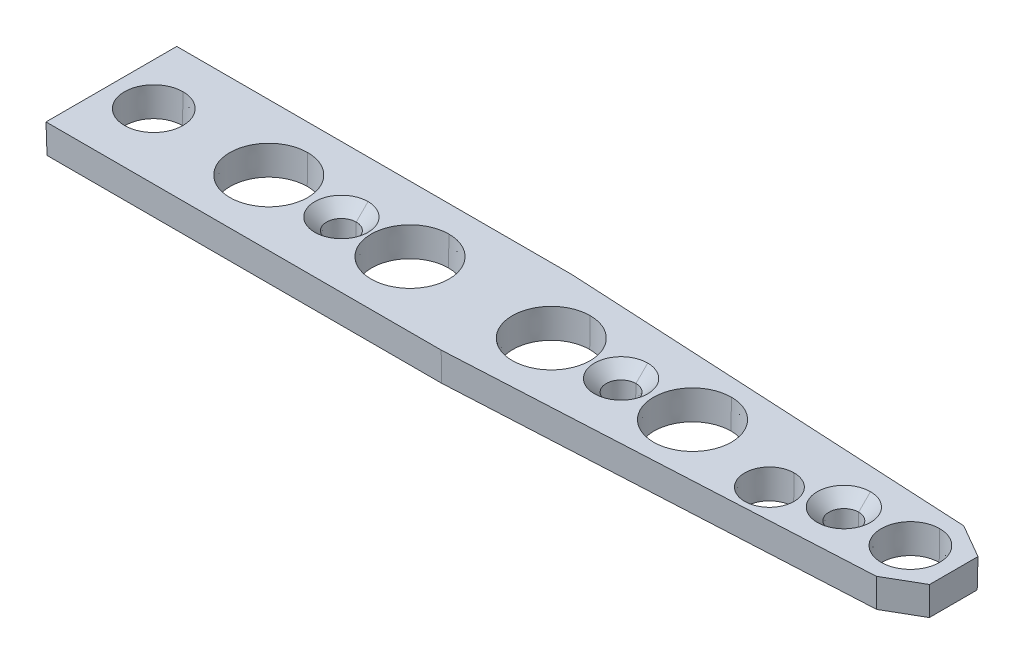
ISO-10303-21;
HEADER;
FILE_DESCRIPTION(('STEP AP214'),'2;1');
FILE_NAME('part.step','',(''),(''),'','','');
FILE_SCHEMA(('AUTOMOTIVE_DESIGN { 1 0 10303 214 1 1 1 1 }'));
ENDSEC;
DATA;
#1=APPLICATION_CONTEXT('core data for automotive mechanical design processes');
#2=APPLICATION_PROTOCOL_DEFINITION('international standard','automotive_design',2000,#1);
#3=PRODUCT_CONTEXT('',#1,'mechanical');
#4=PRODUCT('Part','Part','',(#3));
#5=PRODUCT_RELATED_PRODUCT_CATEGORY('part','',(#4));
#6=PRODUCT_DEFINITION_FORMATION('','',#4);
#7=PRODUCT_DEFINITION_CONTEXT('part definition',#1,'design');
#8=PRODUCT_DEFINITION('design','',#6,#7);
#9=PRODUCT_DEFINITION_SHAPE('','',#8);
#10=(LENGTH_UNIT() NAMED_UNIT(*) SI_UNIT(.MILLI.,.METRE.));
#11=(NAMED_UNIT(*) PLANE_ANGLE_UNIT() SI_UNIT($,.RADIAN.));
#12=(NAMED_UNIT(*) SI_UNIT($,.STERADIAN.) SOLID_ANGLE_UNIT());
#13=UNCERTAINTY_MEASURE_WITH_UNIT(LENGTH_MEASURE(1.E-05),#10,'distance_accuracy_value','');
#14=(GEOMETRIC_REPRESENTATION_CONTEXT(3) GLOBAL_UNCERTAINTY_ASSIGNED_CONTEXT((#13)) GLOBAL_UNIT_ASSIGNED_CONTEXT((#10,
#11,#12)) REPRESENTATION_CONTEXT('',''));
#15=CARTESIAN_POINT('',(0.,0.,0.));
#16=DIRECTION('',(0.,0.,1.));
#17=DIRECTION('',(1.,0.,0.));
#18=AXIS2_PLACEMENT_3D('',#15,#16,#17);
#19=CARTESIAN_POINT('',(56.,-2.4,1.65));
#20=DIRECTION('',(0.,1.,0.));
#21=DIRECTION('',(0.,0.,1.));
#22=AXIS2_PLACEMENT_3D('',#19,#20,#21);
#23=CONICAL_SURFACE('',#22,2.,0.0174532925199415);
#24=DIRECTION('',(0.,0.999847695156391,-0.0174524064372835));
#25=VECTOR('',#24,1.);
#26=CARTESIAN_POINT('',(56.,-2.4,-0.35));
#27=LINE('',#26,#25);
#28=CARTESIAN_POINT('',(56.,-2.4,-0.35));
#29=VERTEX_POINT('',#28);
#30=CARTESIAN_POINT('',(56.,0.,-0.391892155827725));
#31=VERTEX_POINT('',#30);
#32=EDGE_CURVE('E575',#29,#31,#27,.T.);
#33=ORIENTED_EDGE('',*,*,#32,.F.);
#34=CARTESIAN_POINT('',(56.,-2.4,1.65));
#35=DIRECTION('',(0.,1.,0.));
#36=DIRECTION('',(0.,0.,1.));
#37=AXIS2_PLACEMENT_3D('',#34,#35,#36);
#38=CIRCLE('',#37,2.);
#39=CARTESIAN_POINT('',(56.,-2.4,3.65));
#40=VERTEX_POINT('',#39);
#41=EDGE_CURVE('E424',#40,#29,#38,.T.);
#42=ORIENTED_EDGE('',*,*,#41,.F.);
#43=DIRECTION('',(0.,0.999847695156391,0.0174524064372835));
#44=VECTOR('',#43,1.);
#45=CARTESIAN_POINT('',(56.,-2.4,3.65));
#46=LINE('',#45,#44);
#47=CARTESIAN_POINT('',(56.,0.,3.69189215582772));
#48=VERTEX_POINT('',#47);
#49=EDGE_CURVE('E518',#40,#48,#46,.T.);
#50=ORIENTED_EDGE('',*,*,#49,.T.);
#51=CARTESIAN_POINT('',(56.,0.,1.65));
#52=DIRECTION('',(0.,1.,0.));
#53=DIRECTION('',(0.,0.,1.));
#54=AXIS2_PLACEMENT_3D('',#51,#52,#53);
#55=CIRCLE('',#54,2.04189215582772);
#56=EDGE_CURVE('E329',#48,#31,#55,.T.);
#57=ORIENTED_EDGE('',*,*,#56,.T.);
#58=EDGE_LOOP('',(#33,#42,#50,#57));
#59=FACE_BOUND('',#58,.T.);
#60=ADVANCED_FACE('F16',(#59),#23,.F.);
#61=CARTESIAN_POINT('',(13.,-2.4,0.));
#62=DIRECTION('',(0.,1.,0.));
#63=DIRECTION('',(0.,0.,1.));
#64=AXIS2_PLACEMENT_3D('',#61,#62,#63);
#65=CONICAL_SURFACE('',#64,3.175,0.0174532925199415);
#66=DIRECTION('',(0.,0.999847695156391,-0.0174524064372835));
#67=VECTOR('',#66,1.);
#68=CARTESIAN_POINT('',(13.,-2.4,-3.175));
#69=LINE('',#68,#67);
#70=CARTESIAN_POINT('',(13.,-2.4,-3.175));
#71=VERTEX_POINT('',#70);
#72=CARTESIAN_POINT('',(13.,0.,-3.21689215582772));
#73=VERTEX_POINT('',#72);
#74=EDGE_CURVE('E517',#71,#73,#69,.T.);
#75=ORIENTED_EDGE('',*,*,#74,.F.);
#76=CARTESIAN_POINT('',(13.,-2.4,0.));
#77=DIRECTION('',(0.,1.,0.));
#78=DIRECTION('',(0.,0.,1.));
#79=AXIS2_PLACEMENT_3D('',#76,#77,#78);
#80=CIRCLE('',#79,3.175);
#81=CARTESIAN_POINT('',(13.,-2.4,3.175));
#82=VERTEX_POINT('',#81);
#83=EDGE_CURVE('E427',#82,#71,#80,.T.);
#84=ORIENTED_EDGE('',*,*,#83,.F.);
#85=DIRECTION('',(0.,0.999847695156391,0.0174524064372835));
#86=VECTOR('',#85,1.);
#87=CARTESIAN_POINT('',(13.,-2.4,3.175));
#88=LINE('',#87,#86);
#89=CARTESIAN_POINT('',(13.,0.,3.21689215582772));
#90=VERTEX_POINT('',#89);
#91=EDGE_CURVE('E374',#82,#90,#88,.T.);
#92=ORIENTED_EDGE('',*,*,#91,.T.);
#93=CARTESIAN_POINT('',(13.,0.,0.));
#94=DIRECTION('',(0.,1.,0.));
#95=DIRECTION('',(0.,0.,1.));
#96=AXIS2_PLACEMENT_3D('',#93,#94,#95);
#97=CIRCLE('',#96,3.21689215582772);
#98=EDGE_CURVE('E397',#90,#73,#97,.T.);
#99=ORIENTED_EDGE('',*,*,#98,.T.);
#100=EDGE_LOOP('',(#75,#84,#92,#99));
#101=FACE_BOUND('',#100,.T.);
#102=ADVANCED_FACE('F650',(#101),#65,.F.);
#103=CARTESIAN_POINT('',(24.6666666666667,-2.4,0.));
#104=DIRECTION('',(0.,1.,0.));
#105=DIRECTION('',(0.,0.,1.));
#106=AXIS2_PLACEMENT_3D('',#103,#104,#105);
#107=CONICAL_SURFACE('',#106,3.175,0.0174532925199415);
#108=DIRECTION('',(0.,0.999847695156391,-0.0174524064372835));
#109=VECTOR('',#108,1.);
#110=CARTESIAN_POINT('',(24.6666666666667,-2.4,-3.175));
#111=LINE('',#110,#109);
#112=CARTESIAN_POINT('',(24.6666666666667,-2.4,-3.175));
#113=VERTEX_POINT('',#112);
#114=CARTESIAN_POINT('',(24.6666666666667,0.,-3.21689215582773));
#115=VERTEX_POINT('',#114);
#116=EDGE_CURVE('E373',#113,#115,#111,.T.);
#117=ORIENTED_EDGE('',*,*,#116,.F.);
#118=CARTESIAN_POINT('',(24.6666666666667,-2.4,0.));
#119=DIRECTION('',(0.,1.,0.));
#120=DIRECTION('',(0.,0.,1.));
#121=AXIS2_PLACEMENT_3D('',#118,#119,#120);
#122=CIRCLE('',#121,3.175);
#123=CARTESIAN_POINT('',(24.6666666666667,-2.4,3.175));
#124=VERTEX_POINT('',#123);
#125=EDGE_CURVE('E145',#124,#113,#122,.T.);
#126=ORIENTED_EDGE('',*,*,#125,.F.);
#127=DIRECTION('',(0.,0.999847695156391,0.0174524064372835));
#128=VECTOR('',#127,1.);
#129=CARTESIAN_POINT('',(24.6666666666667,-2.4,3.175));
#130=LINE('',#129,#128);
#131=CARTESIAN_POINT('',(24.6666666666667,0.,3.21689215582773));
#132=VERTEX_POINT('',#131);
#133=EDGE_CURVE('E394',#124,#132,#130,.T.);
#134=ORIENTED_EDGE('',*,*,#133,.T.);
#135=CARTESIAN_POINT('',(24.6666666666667,0.,0.));
#136=DIRECTION('',(0.,1.,0.));
#137=DIRECTION('',(0.,0.,1.));
#138=AXIS2_PLACEMENT_3D('',#135,#136,#137);
#139=CIRCLE('',#138,3.21689215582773);
#140=EDGE_CURVE('E134',#132,#115,#139,.T.);
#141=ORIENTED_EDGE('',*,*,#140,.T.);
#142=EDGE_LOOP('',(#117,#126,#134,#141));
#143=FACE_BOUND('',#142,.T.);
#144=ADVANCED_FACE('F708',(#143),#107,.F.);
#145=CARTESIAN_POINT('',(36.3333333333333,-2.4,0.));
#146=DIRECTION('',(0.,1.,0.));
#147=DIRECTION('',(0.,0.,1.));
#148=AXIS2_PLACEMENT_3D('',#145,#146,#147);
#149=CONICAL_SURFACE('',#148,3.175,0.0174532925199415);
#150=DIRECTION('',(0.,0.999847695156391,-0.0174524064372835));
#151=VECTOR('',#150,1.);
#152=CARTESIAN_POINT('',(36.3333333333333,-2.4,-3.175));
#153=LINE('',#152,#151);
#154=CARTESIAN_POINT('',(36.3333333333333,-2.4,-3.175));
#155=VERTEX_POINT('',#154);
#156=CARTESIAN_POINT('',(36.3333333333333,0.,-3.21689215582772));
#157=VERTEX_POINT('',#156);
#158=EDGE_CURVE('E433',#155,#157,#153,.T.);
#159=ORIENTED_EDGE('',*,*,#158,.F.);
#160=CARTESIAN_POINT('',(36.3333333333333,-2.4,0.));
#161=DIRECTION('',(0.,1.,0.));
#162=DIRECTION('',(0.,0.,1.));
#163=AXIS2_PLACEMENT_3D('',#160,#161,#162);
#164=CIRCLE('',#163,3.175);
#165=CARTESIAN_POINT('',(36.3333333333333,-2.4,3.175));
#166=VERTEX_POINT('',#165);
#167=EDGE_CURVE('E458',#166,#155,#164,.T.);
#168=ORIENTED_EDGE('',*,*,#167,.F.);
#169=DIRECTION('',(0.,0.999847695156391,0.0174524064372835));
#170=VECTOR('',#169,1.);
#171=CARTESIAN_POINT('',(36.3333333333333,-2.4,3.175));
#172=LINE('',#171,#170);
#173=CARTESIAN_POINT('',(36.3333333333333,0.,3.21689215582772));
#174=VERTEX_POINT('',#173);
#175=EDGE_CURVE('E432',#166,#174,#172,.T.);
#176=ORIENTED_EDGE('',*,*,#175,.T.);
#177=CARTESIAN_POINT('',(36.3333333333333,0.,0.));
#178=DIRECTION('',(0.,1.,0.));
#179=DIRECTION('',(0.,0.,1.));
#180=AXIS2_PLACEMENT_3D('',#177,#178,#179);
#181=CIRCLE('',#180,3.21689215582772);
#182=EDGE_CURVE('E440',#174,#157,#181,.T.);
#183=ORIENTED_EDGE('',*,*,#182,.T.);
#184=EDGE_LOOP('',(#159,#168,#176,#183));
#185=FACE_BOUND('',#184,.T.);
#186=ADVANCED_FACE('F760',(#185),#149,.F.);
#187=CARTESIAN_POINT('',(48.,-2.4,0.));
#188=DIRECTION('',(0.,1.,0.));
#189=DIRECTION('',(0.,0.,1.));
#190=AXIS2_PLACEMENT_3D('',#187,#188,#189);
#191=CONICAL_SURFACE('',#190,3.175,0.0174532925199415);
#192=DIRECTION('',(0.,0.999847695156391,-0.0174524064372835));
#193=VECTOR('',#192,1.);
#194=CARTESIAN_POINT('',(48.,-2.4,-3.175));
#195=LINE('',#194,#193);
#196=CARTESIAN_POINT('',(48.,-2.4,-3.175));
#197=VERTEX_POINT('',#196);
#198=CARTESIAN_POINT('',(48.,0.,-3.21689215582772));
#199=VERTEX_POINT('',#198);
#200=EDGE_CURVE('E407',#197,#199,#195,.T.);
#201=ORIENTED_EDGE('',*,*,#200,.F.);
#202=CARTESIAN_POINT('',(48.,-2.4,0.));
#203=DIRECTION('',(0.,1.,0.));
#204=DIRECTION('',(0.,0.,1.));
#205=AXIS2_PLACEMENT_3D('',#202,#203,#204);
#206=CIRCLE('',#205,3.175);
#207=CARTESIAN_POINT('',(48.,-2.4,3.175));
#208=VERTEX_POINT('',#207);
#209=EDGE_CURVE('E437',#208,#197,#206,.T.);
#210=ORIENTED_EDGE('',*,*,#209,.F.);
#211=DIRECTION('',(0.,0.999847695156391,0.0174524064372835));
#212=VECTOR('',#211,1.);
#213=CARTESIAN_POINT('',(48.,-2.4,3.175));
#214=LINE('',#213,#212);
#215=CARTESIAN_POINT('',(48.,0.,3.21689215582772));
#216=VERTEX_POINT('',#215);
#217=EDGE_CURVE('E493',#208,#216,#214,.T.);
#218=ORIENTED_EDGE('',*,*,#217,.T.);
#219=CARTESIAN_POINT('',(48.,0.,0.));
#220=DIRECTION('',(0.,1.,0.));
#221=DIRECTION('',(0.,0.,1.));
#222=AXIS2_PLACEMENT_3D('',#219,#220,#221);
#223=CIRCLE('',#222,3.21689215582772);
#224=EDGE_CURVE('E448',#216,#199,#223,.T.);
#225=ORIENTED_EDGE('',*,*,#224,.T.);
#226=EDGE_LOOP('',(#201,#210,#218,#225));
#227=FACE_BOUND('',#226,.T.);
#228=ADVANCED_FACE('F757',(#227),#191,.F.);
#229=CARTESIAN_POINT('',(19.,0.,0.));
#230=DIRECTION('',(0.,1.,0.));
#231=DIRECTION('',(0.,0.,1.));
#232=AXIS2_PLACEMENT_3D('',#229,#230,#231);
#233=CONICAL_SURFACE('',#232,2.2,0.785398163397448);
#234=DIRECTION('',(0.,0.707106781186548,-0.707106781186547));
#235=VECTOR('',#234,1.);
#236=CARTESIAN_POINT('',(19.,0.,-2.2));
#237=LINE('',#236,#235);
#238=CARTESIAN_POINT('',(19.,-0.975128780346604,-1.2248712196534));
#239=VERTEX_POINT('',#238);
#240=CARTESIAN_POINT('',(19.,0.,-2.2));
#241=VERTEX_POINT('',#240);
#242=EDGE_CURVE('E492',#239,#241,#237,.T.);
#243=ORIENTED_EDGE('',*,*,#242,.F.);
#244=CARTESIAN_POINT('',(19.,-0.975128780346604,0.));
#245=DIRECTION('',(0.,1.,0.));
#246=DIRECTION('',(0.,0.,1.));
#247=AXIS2_PLACEMENT_3D('',#244,#245,#246);
#248=CIRCLE('',#247,1.2248712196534);
#249=CARTESIAN_POINT('',(19.,-0.975128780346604,1.2248712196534));
#250=VERTEX_POINT('',#249);
#251=EDGE_CURVE('E10',#250,#239,#248,.T.);
#252=ORIENTED_EDGE('',*,*,#251,.F.);
#253=DIRECTION('',(0.,0.707106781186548,0.707106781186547));
#254=VECTOR('',#253,1.);
#255=CARTESIAN_POINT('',(19.,0.,2.2));
#256=LINE('',#255,#254);
#257=CARTESIAN_POINT('',(19.,0.,2.2));
#258=VERTEX_POINT('',#257);
#259=EDGE_CURVE('E491',#250,#258,#256,.T.);
#260=ORIENTED_EDGE('',*,*,#259,.T.);
#261=CARTESIAN_POINT('',(19.,0.,0.));
#262=DIRECTION('',(0.,1.,0.));
#263=DIRECTION('',(0.,0.,1.));
#264=AXIS2_PLACEMENT_3D('',#261,#262,#263);
#265=CIRCLE('',#264,2.2);
#266=EDGE_CURVE('E559',#258,#241,#265,.T.);
#267=ORIENTED_EDGE('',*,*,#266,.T.);
#268=EDGE_LOOP('',(#243,#252,#260,#267));
#269=FACE_BOUND('',#268,.T.);
#270=ADVANCED_FACE('F759',(#269),#233,.F.);
#271=CARTESIAN_POINT('',(19.,-2.4,0.));
#272=DIRECTION('',(0.,1.,0.));
#273=DIRECTION('',(0.,0.,1.));
#274=AXIS2_PLACEMENT_3D('',#271,#272,#273);
#275=CONICAL_SURFACE('',#274,1.2,0.0174532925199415);
#276=DIRECTION('',(0.,0.999847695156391,-0.0174524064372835));
#277=VECTOR('',#276,1.);
#278=CARTESIAN_POINT('',(19.,-2.4,-1.2));
#279=LINE('',#278,#277);
#280=CARTESIAN_POINT('',(19.,-2.4,-1.2));
#281=VERTEX_POINT('',#280);
#282=EDGE_CURVE('E535',#281,#239,#279,.T.);
#283=ORIENTED_EDGE('',*,*,#282,.F.);
#284=CARTESIAN_POINT('',(19.,-2.4,0.));
#285=DIRECTION('',(0.,1.,0.));
#286=DIRECTION('',(0.,0.,1.));
#287=AXIS2_PLACEMENT_3D('',#284,#285,#286);
#288=CIRCLE('',#287,1.2);
#289=CARTESIAN_POINT('',(19.,-2.4,1.2));
#290=VERTEX_POINT('',#289);
#291=EDGE_CURVE('E247',#290,#281,#288,.T.);
#292=ORIENTED_EDGE('',*,*,#291,.F.);
#293=DIRECTION('',(0.,0.999847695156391,0.0174524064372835));
#294=VECTOR('',#293,1.);
#295=CARTESIAN_POINT('',(19.,-2.4,1.2));
#296=LINE('',#295,#294);
#297=EDGE_CURVE('E532',#290,#250,#296,.T.);
#298=ORIENTED_EDGE('',*,*,#297,.T.);
#299=ORIENTED_EDGE('',*,*,#251,.T.);
#300=EDGE_LOOP('',(#283,#292,#298,#299));
#301=FACE_BOUND('',#300,.T.);
#302=ADVANCED_FACE('F767',(#301),#275,.F.);
#303=CARTESIAN_POINT('',(42.1,0.,0.));
#304=DIRECTION('',(0.,1.,0.));
#305=DIRECTION('',(0.,0.,1.));
#306=AXIS2_PLACEMENT_3D('',#303,#304,#305);
#307=CONICAL_SURFACE('',#306,2.2,0.785398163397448);
#308=DIRECTION('',(0.,0.707106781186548,-0.707106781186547));
#309=VECTOR('',#308,1.);
#310=CARTESIAN_POINT('',(42.1,0.,-2.2));
#311=LINE('',#310,#309);
#312=CARTESIAN_POINT('',(42.1,-0.975128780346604,-1.2248712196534));
#313=VERTEX_POINT('',#312);
#314=CARTESIAN_POINT('',(42.1,0.,-2.2));
#315=VERTEX_POINT('',#314);
#316=EDGE_CURVE('E358',#313,#315,#311,.T.);
#317=ORIENTED_EDGE('',*,*,#316,.F.);
#318=CARTESIAN_POINT('',(42.1,-0.975128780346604,0.));
#319=DIRECTION('',(0.,1.,0.));
#320=DIRECTION('',(0.,0.,1.));
#321=AXIS2_PLACEMENT_3D('',#318,#319,#320);
#322=CIRCLE('',#321,1.2248712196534);
#323=CARTESIAN_POINT('',(42.1,-0.975128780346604,1.2248712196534));
#324=VERTEX_POINT('',#323);
#325=EDGE_CURVE('E27',#324,#313,#322,.T.);
#326=ORIENTED_EDGE('',*,*,#325,.F.);
#327=DIRECTION('',(0.,0.707106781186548,0.707106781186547));
#328=VECTOR('',#327,1.);
#329=CARTESIAN_POINT('',(42.1,0.,2.2));
#330=LINE('',#329,#328);
#331=CARTESIAN_POINT('',(42.1,0.,2.2));
#332=VERTEX_POINT('',#331);
#333=EDGE_CURVE('E581',#324,#332,#330,.T.);
#334=ORIENTED_EDGE('',*,*,#333,.T.);
#335=CARTESIAN_POINT('',(42.1,0.,0.));
#336=DIRECTION('',(0.,1.,0.));
#337=DIRECTION('',(0.,0.,1.));
#338=AXIS2_PLACEMENT_3D('',#335,#336,#337);
#339=CIRCLE('',#338,2.2);
#340=EDGE_CURVE('E599',#332,#315,#339,.T.);
#341=ORIENTED_EDGE('',*,*,#340,.T.);
#342=EDGE_LOOP('',(#317,#326,#334,#341));
#343=FACE_BOUND('',#342,.T.);
#344=ADVANCED_FACE('F726',(#343),#307,.F.);
#345=CARTESIAN_POINT('',(42.1,-2.4,0.));
#346=DIRECTION('',(0.,1.,0.));
#347=DIRECTION('',(0.,0.,1.));
#348=AXIS2_PLACEMENT_3D('',#345,#346,#347);
#349=CONICAL_SURFACE('',#348,1.2,0.0174532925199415);
#350=DIRECTION('',(0.,0.999847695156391,-0.0174524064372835));
#351=VECTOR('',#350,1.);
#352=CARTESIAN_POINT('',(42.1,-2.4,-1.2));
#353=LINE('',#352,#351);
#354=CARTESIAN_POINT('',(42.1,-2.4,-1.2));
#355=VERTEX_POINT('',#354);
#356=EDGE_CURVE('E364',#355,#313,#353,.T.);
#357=ORIENTED_EDGE('',*,*,#356,.F.);
#358=CARTESIAN_POINT('',(42.1,-2.4,0.));
#359=DIRECTION('',(0.,1.,0.));
#360=DIRECTION('',(0.,0.,1.));
#361=AXIS2_PLACEMENT_3D('',#358,#359,#360);
#362=CIRCLE('',#361,1.2);
#363=CARTESIAN_POINT('',(42.1,-2.4,1.2));
#364=VERTEX_POINT('',#363);
#365=EDGE_CURVE('E436',#364,#355,#362,.T.);
#366=ORIENTED_EDGE('',*,*,#365,.F.);
#367=DIRECTION('',(0.,0.999847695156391,0.0174524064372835));
#368=VECTOR('',#367,1.);
#369=CARTESIAN_POINT('',(42.1,-2.4,1.2));
#370=LINE('',#369,#368);
#371=EDGE_CURVE('E367',#364,#324,#370,.T.);
#372=ORIENTED_EDGE('',*,*,#371,.T.);
#373=ORIENTED_EDGE('',*,*,#325,.T.);
#374=EDGE_LOOP('',(#357,#366,#372,#373));
#375=FACE_BOUND('',#374,.T.);
#376=ADVANCED_FACE('F723',(#375),#349,.F.);
#377=CARTESIAN_POINT('',(60.5,0.,0.));
#378=DIRECTION('',(0.,1.,0.));
#379=DIRECTION('',(0.,0.,1.));
#380=AXIS2_PLACEMENT_3D('',#377,#378,#379);
#381=CONICAL_SURFACE('',#380,2.2,0.785398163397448);
#382=DIRECTION('',(0.,0.707106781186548,-0.707106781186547));
#383=VECTOR('',#382,1.);
#384=CARTESIAN_POINT('',(60.5,0.,-2.2));
#385=LINE('',#384,#383);
#386=CARTESIAN_POINT('',(60.5,-0.975128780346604,-1.2248712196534));
#387=VERTEX_POINT('',#386);
#388=CARTESIAN_POINT('',(60.5,0.,-2.2));
#389=VERTEX_POINT('',#388);
#390=EDGE_CURVE('E452',#387,#389,#385,.T.);
#391=ORIENTED_EDGE('',*,*,#390,.F.);
#392=CARTESIAN_POINT('',(60.5,-0.975128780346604,0.));
#393=DIRECTION('',(0.,1.,0.));
#394=DIRECTION('',(0.,0.,1.));
#395=AXIS2_PLACEMENT_3D('',#392,#393,#394);
#396=CIRCLE('',#395,1.2248712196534);
#397=CARTESIAN_POINT('',(60.5,-0.975128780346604,1.2248712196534));
#398=VERTEX_POINT('',#397);
#399=EDGE_CURVE('E466',#398,#387,#396,.T.);
#400=ORIENTED_EDGE('',*,*,#399,.F.);
#401=DIRECTION('',(0.,0.707106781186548,0.707106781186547));
#402=VECTOR('',#401,1.);
#403=CARTESIAN_POINT('',(60.5,0.,2.2));
#404=LINE('',#403,#402);
#405=CARTESIAN_POINT('',(60.5,0.,2.2));
#406=VERTEX_POINT('',#405);
#407=EDGE_CURVE('E596',#398,#406,#404,.T.);
#408=ORIENTED_EDGE('',*,*,#407,.T.);
#409=CARTESIAN_POINT('',(60.5,0.,0.));
#410=DIRECTION('',(0.,1.,0.));
#411=DIRECTION('',(0.,0.,1.));
#412=AXIS2_PLACEMENT_3D('',#409,#410,#411);
#413=CIRCLE('',#412,2.2);
#414=EDGE_CURVE('E20',#406,#389,#413,.T.);
#415=ORIENTED_EDGE('',*,*,#414,.T.);
#416=EDGE_LOOP('',(#391,#400,#408,#415));
#417=FACE_BOUND('',#416,.T.);
#418=ADVANCED_FACE('F716',(#417),#381,.F.);
#419=CARTESIAN_POINT('',(60.5,-2.4,0.));
#420=DIRECTION('',(0.,1.,0.));
#421=DIRECTION('',(0.,0.,1.));
#422=AXIS2_PLACEMENT_3D('',#419,#420,#421);
#423=CONICAL_SURFACE('',#422,1.2,0.0174532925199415);
#424=DIRECTION('',(0.,0.999847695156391,-0.0174524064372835));
#425=VECTOR('',#424,1.);
#426=CARTESIAN_POINT('',(60.5,-2.4,-1.2));
#427=LINE('',#426,#425);
#428=CARTESIAN_POINT('',(60.5,-2.4,-1.2));
#429=VERTEX_POINT('',#428);
#430=EDGE_CURVE('E531',#429,#387,#427,.T.);
#431=ORIENTED_EDGE('',*,*,#430,.F.);
#432=CARTESIAN_POINT('',(60.5,-2.4,0.));
#433=DIRECTION('',(0.,1.,0.));
#434=DIRECTION('',(0.,0.,1.));
#435=AXIS2_PLACEMENT_3D('',#432,#433,#434);
#436=CIRCLE('',#435,1.2);
#437=CARTESIAN_POINT('',(60.5,-2.4,1.2));
#438=VERTEX_POINT('',#437);
#439=EDGE_CURVE('E463',#438,#429,#436,.T.);
#440=ORIENTED_EDGE('',*,*,#439,.F.);
#441=DIRECTION('',(0.,0.999847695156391,0.0174524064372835));
#442=VECTOR('',#441,1.);
#443=CARTESIAN_POINT('',(60.5,-2.4,1.2));
#444=LINE('',#443,#442);
#445=EDGE_CURVE('E512',#438,#398,#444,.T.);
#446=ORIENTED_EDGE('',*,*,#445,.T.);
#447=ORIENTED_EDGE('',*,*,#399,.T.);
#448=EDGE_LOOP('',(#431,#440,#446,#447));
#449=FACE_BOUND('',#448,.T.);
#450=ADVANCED_FACE('F712',(#449),#423,.F.);
#451=CARTESIAN_POINT('',(3.5,-2.4,0.));
#452=DIRECTION('',(0.,1.,0.));
#453=DIRECTION('',(0.,0.,1.));
#454=AXIS2_PLACEMENT_3D('',#451,#452,#453);
#455=CONICAL_SURFACE('',#454,2.375,0.0174532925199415);
#456=DIRECTION('',(0.,0.999847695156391,-0.0174524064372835));
#457=VECTOR('',#456,1.);
#458=CARTESIAN_POINT('',(3.5,-2.4,-2.375));
#459=LINE('',#458,#457);
#460=CARTESIAN_POINT('',(3.5,-2.4,-2.375));
#461=VERTEX_POINT('',#460);
#462=CARTESIAN_POINT('',(3.5,0.,-2.41689215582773));
#463=VERTEX_POINT('',#462);
#464=EDGE_CURVE('E401',#461,#463,#459,.T.);
#465=ORIENTED_EDGE('',*,*,#464,.F.);
#466=CARTESIAN_POINT('',(3.5,-2.4,0.));
#467=DIRECTION('',(0.,1.,0.));
#468=DIRECTION('',(0.,0.,1.));
#469=AXIS2_PLACEMENT_3D('',#466,#467,#468);
#470=CIRCLE('',#469,2.375);
#471=CARTESIAN_POINT('',(3.5,-2.4,2.375));
#472=VERTEX_POINT('',#471);
#473=EDGE_CURVE('E467',#472,#461,#470,.T.);
#474=ORIENTED_EDGE('',*,*,#473,.F.);
#475=DIRECTION('',(0.,0.999847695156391,0.0174524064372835));
#476=VECTOR('',#475,1.);
#477=CARTESIAN_POINT('',(3.5,-2.4,2.375));
#478=LINE('',#477,#476);
#479=CARTESIAN_POINT('',(3.5,0.,2.41689215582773));
#480=VERTEX_POINT('',#479);
#481=EDGE_CURVE('E548',#472,#480,#478,.T.);
#482=ORIENTED_EDGE('',*,*,#481,.T.);
#483=CARTESIAN_POINT('',(3.5,0.,0.));
#484=DIRECTION('',(0.,1.,0.));
#485=DIRECTION('',(0.,0.,1.));
#486=AXIS2_PLACEMENT_3D('',#483,#484,#485);
#487=CIRCLE('',#486,2.41689215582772);
#488=EDGE_CURVE('E521',#480,#463,#487,.T.);
#489=ORIENTED_EDGE('',*,*,#488,.T.);
#490=EDGE_LOOP('',(#465,#474,#482,#489));
#491=FACE_BOUND('',#490,.T.);
#492=ADVANCED_FACE('F715',(#491),#455,.F.);
#493=CARTESIAN_POINT('',(66.,-2.4,0.));
#494=DIRECTION('',(0.,1.,0.));
#495=DIRECTION('',(0.,0.,1.));
#496=AXIS2_PLACEMENT_3D('',#493,#494,#495);
#497=CONICAL_SURFACE('',#496,2.375,0.0174532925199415);
#498=DIRECTION('',(0.,0.999847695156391,-0.0174524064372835));
#499=VECTOR('',#498,1.);
#500=CARTESIAN_POINT('',(66.,-2.4,-2.375));
#501=LINE('',#500,#499);
#502=CARTESIAN_POINT('',(66.,-2.4,-2.375));
#503=VERTEX_POINT('',#502);
#504=CARTESIAN_POINT('',(66.,0.,-2.41689215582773));
#505=VERTEX_POINT('',#504);
#506=EDGE_CURVE('E356',#503,#505,#501,.T.);
#507=ORIENTED_EDGE('',*,*,#506,.F.);
#508=CARTESIAN_POINT('',(66.,-2.4,0.));
#509=DIRECTION('',(0.,1.,0.));
#510=DIRECTION('',(0.,0.,1.));
#511=AXIS2_PLACEMENT_3D('',#508,#509,#510);
#512=CIRCLE('',#511,2.375);
#513=CARTESIAN_POINT('',(66.,-2.4,2.375));
#514=VERTEX_POINT('',#513);
#515=EDGE_CURVE('E180',#514,#503,#512,.T.);
#516=ORIENTED_EDGE('',*,*,#515,.F.);
#517=DIRECTION('',(0.,0.999847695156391,0.0174524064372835));
#518=VECTOR('',#517,1.);
#519=CARTESIAN_POINT('',(66.,-2.4,2.375));
#520=LINE('',#519,#518);
#521=CARTESIAN_POINT('',(66.,0.,2.41689215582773));
#522=VERTEX_POINT('',#521);
#523=EDGE_CURVE('E352',#514,#522,#520,.T.);
#524=ORIENTED_EDGE('',*,*,#523,.T.);
#525=CARTESIAN_POINT('',(66.,0.,0.));
#526=DIRECTION('',(0.,1.,0.));
#527=DIRECTION('',(0.,0.,1.));
#528=AXIS2_PLACEMENT_3D('',#525,#526,#527);
#529=CIRCLE('',#528,2.41689215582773);
#530=EDGE_CURVE('E168',#522,#505,#529,.T.);
#531=ORIENTED_EDGE('',*,*,#530,.T.);
#532=EDGE_LOOP('',(#507,#516,#524,#531));
#533=FACE_BOUND('',#532,.T.);
#534=ADVANCED_FACE('F661',(#533),#497,.F.);
#535=CARTESIAN_POINT('',(0.,-2.4,0.));
#536=DIRECTION('',(0.,1.,0.));
#537=DIRECTION('',(1.,0.,0.));
#538=AXIS2_PLACEMENT_3D('',#535,#536,#537);
#539=PLANE('',#538);
#540=ORIENTED_EDGE('',*,*,#515,.T.);
#541=CARTESIAN_POINT('',(66.,-2.4,0.));
#542=DIRECTION('',(0.,1.,0.));
#543=DIRECTION('',(0.,0.,1.));
#544=AXIS2_PLACEMENT_3D('',#541,#542,#543);
#545=CIRCLE('',#544,2.375);
#546=EDGE_CURVE('E544',#503,#514,#545,.T.);
#547=ORIENTED_EDGE('',*,*,#546,.T.);
#548=EDGE_LOOP('',(#540,#547));
#549=FACE_BOUND('',#548,.T.);
#550=ORIENTED_EDGE('',*,*,#473,.T.);
#551=CARTESIAN_POINT('',(3.5,-2.4,0.));
#552=DIRECTION('',(0.,1.,0.));
#553=DIRECTION('',(0.,0.,1.));
#554=AXIS2_PLACEMENT_3D('',#551,#552,#553);
#555=CIRCLE('',#554,2.375);
#556=EDGE_CURVE('E406',#461,#472,#555,.T.);
#557=ORIENTED_EDGE('',*,*,#556,.T.);
#558=EDGE_LOOP('',(#550,#557));
#559=FACE_BOUND('',#558,.T.);
#560=ORIENTED_EDGE('',*,*,#439,.T.);
#561=CARTESIAN_POINT('',(60.5,-2.4,0.));
#562=DIRECTION('',(0.,1.,0.));
#563=DIRECTION('',(0.,0.,1.));
#564=AXIS2_PLACEMENT_3D('',#561,#562,#563);
#565=CIRCLE('',#564,1.2);
#566=EDGE_CURVE('E585',#429,#438,#565,.T.);
#567=ORIENTED_EDGE('',*,*,#566,.T.);
#568=EDGE_LOOP('',(#560,#567));
#569=FACE_BOUND('',#568,.T.);
#570=ORIENTED_EDGE('',*,*,#365,.T.);
#571=CARTESIAN_POINT('',(42.1,-2.4,0.));
#572=DIRECTION('',(0.,1.,0.));
#573=DIRECTION('',(0.,0.,1.));
#574=AXIS2_PLACEMENT_3D('',#571,#572,#573);
#575=CIRCLE('',#574,1.2);
#576=EDGE_CURVE('E368',#355,#364,#575,.T.);
#577=ORIENTED_EDGE('',*,*,#576,.T.);
#578=EDGE_LOOP('',(#570,#577));
#579=FACE_BOUND('',#578,.T.);
#580=ORIENTED_EDGE('',*,*,#291,.T.);
#581=CARTESIAN_POINT('',(19.,-2.4,0.));
#582=DIRECTION('',(0.,1.,0.));
#583=DIRECTION('',(0.,0.,1.));
#584=AXIS2_PLACEMENT_3D('',#581,#582,#583);
#585=CIRCLE('',#584,1.2);
#586=EDGE_CURVE('E507',#281,#290,#585,.T.);
#587=ORIENTED_EDGE('',*,*,#586,.T.);
#588=EDGE_LOOP('',(#580,#587));
#589=FACE_BOUND('',#588,.T.);
#590=ORIENTED_EDGE('',*,*,#209,.T.);
#591=CARTESIAN_POINT('',(48.,-2.4,0.));
#592=DIRECTION('',(0.,1.,0.));
#593=DIRECTION('',(0.,0.,1.));
#594=AXIS2_PLACEMENT_3D('',#591,#592,#593);
#595=CIRCLE('',#594,3.175);
#596=EDGE_CURVE('E412',#197,#208,#595,.T.);
#597=ORIENTED_EDGE('',*,*,#596,.T.);
#598=EDGE_LOOP('',(#590,#597));
#599=FACE_BOUND('',#598,.T.);
#600=ORIENTED_EDGE('',*,*,#167,.T.);
#601=CARTESIAN_POINT('',(36.3333333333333,-2.4,0.));
#602=DIRECTION('',(0.,1.,0.));
#603=DIRECTION('',(0.,0.,1.));
#604=AXIS2_PLACEMENT_3D('',#601,#602,#603);
#605=CIRCLE('',#604,3.175);
#606=EDGE_CURVE('E471',#155,#166,#605,.T.);
#607=ORIENTED_EDGE('',*,*,#606,.T.);
#608=EDGE_LOOP('',(#600,#607));
#609=FACE_BOUND('',#608,.T.);
#610=ORIENTED_EDGE('',*,*,#125,.T.);
#611=CARTESIAN_POINT('',(24.6666666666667,-2.4,0.));
#612=DIRECTION('',(0.,1.,0.));
#613=DIRECTION('',(0.,0.,1.));
#614=AXIS2_PLACEMENT_3D('',#611,#612,#613);
#615=CIRCLE('',#614,3.175);
#616=EDGE_CURVE('E369',#113,#124,#615,.T.);
#617=ORIENTED_EDGE('',*,*,#616,.T.);
#618=EDGE_LOOP('',(#610,#617));
#619=FACE_BOUND('',#618,.T.);
#620=ORIENTED_EDGE('',*,*,#83,.T.);
#621=CARTESIAN_POINT('',(13.,-2.4,0.));
#622=DIRECTION('',(0.,1.,0.));
#623=DIRECTION('',(0.,0.,1.));
#624=AXIS2_PLACEMENT_3D('',#621,#622,#623);
#625=CIRCLE('',#624,3.175);
#626=EDGE_CURVE('E513',#71,#82,#625,.T.);
#627=ORIENTED_EDGE('',*,*,#626,.T.);
#628=EDGE_LOOP('',(#620,#627));
#629=FACE_BOUND('',#628,.T.);
#630=ORIENTED_EDGE('',*,*,#41,.T.);
#631=CARTESIAN_POINT('',(56.,-2.4,1.65));
#632=DIRECTION('',(0.,1.,0.));
#633=DIRECTION('',(0.,0.,1.));
#634=AXIS2_PLACEMENT_3D('',#631,#632,#633);
#635=CIRCLE('',#634,2.);
#636=EDGE_CURVE('E592',#29,#40,#635,.T.);
#637=ORIENTED_EDGE('',*,*,#636,.T.);
#638=EDGE_LOOP('',(#630,#637));
#639=FACE_BOUND('',#638,.T.);
#640=DIRECTION('',(-0.998629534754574,0.,0.0523359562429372));
#641=VECTOR('',#640,1.);
#642=CARTESIAN_POINT('',(66.7887830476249,-2.4,3.5684092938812));
#643=LINE('',#642,#641);
#644=CARTESIAN_POINT('',(66.7787394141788,-2.4,3.56893565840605));
#645=VERTEX_POINT('',#644);
#646=CARTESIAN_POINT('',(32.6393003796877,-2.4,5.35810784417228));
#647=VERTEX_POINT('',#646);
#648=EDGE_CURVE('E345',#645,#647,#643,.T.);
#649=ORIENTED_EDGE('',*,*,#648,.T.);
#650=DIRECTION('',(-1.,0.,0.));
#651=VECTOR('',#650,1.);
#652=CARTESIAN_POINT('',(32.6403973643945,-2.4,5.35810784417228));
#653=LINE('',#652,#651);
#654=CARTESIAN_POINT('',(0.0418921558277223,-2.4,5.35810784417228));
#655=VERTEX_POINT('',#654);
#656=EDGE_CURVE('E400',#647,#655,#653,.T.);
#657=ORIENTED_EDGE('',*,*,#656,.T.);
#658=DIRECTION('',(0.,0.,-1.));
#659=VECTOR('',#658,1.);
#660=CARTESIAN_POINT('',(0.0418921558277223,-2.4,-5.4));
#661=LINE('',#660,#659);
#662=CARTESIAN_POINT('',(0.0418921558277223,-2.4,-5.35810784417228));
#663=VERTEX_POINT('',#662);
#664=EDGE_CURVE('E478',#655,#663,#661,.T.);
#665=ORIENTED_EDGE('',*,*,#664,.T.);
#666=DIRECTION('',(1.,0.,0.));
#667=VECTOR('',#666,1.);
#668=CARTESIAN_POINT('',(0.,-2.4,-5.35810784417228));
#669=LINE('',#668,#667);
#670=CARTESIAN_POINT('',(32.6393003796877,-2.4,-5.35810784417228));
#671=VERTEX_POINT('',#670);
#672=EDGE_CURVE('E378',#663,#671,#669,.T.);
#673=ORIENTED_EDGE('',*,*,#672,.T.);
#674=DIRECTION('',(0.998629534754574,0.,0.0523359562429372));
#675=VECTOR('',#674,1.);
#676=CARTESIAN_POINT('',(32.6382048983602,-2.4,-5.3581652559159));
#677=LINE('',#676,#675);
#678=CARTESIAN_POINT('',(66.7787394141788,-2.4,-3.56893565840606));
#679=VERTEX_POINT('',#678);
#680=EDGE_CURVE('E419',#671,#679,#677,.T.);
#681=ORIENTED_EDGE('',*,*,#680,.T.);
#682=DIRECTION('',(0.866025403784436,0.,0.5));
#683=VECTOR('',#682,1.);
#684=CARTESIAN_POINT('',(69.5590539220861,-2.4,-1.96372032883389));
#685=LINE('',#684,#683);
#686=CARTESIAN_POINT('',(69.5381078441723,-2.4,-1.97581355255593));
#687=VERTEX_POINT('',#686);
#688=EDGE_CURVE('E388',#679,#687,#685,.T.);
#689=ORIENTED_EDGE('',*,*,#688,.T.);
#690=DIRECTION('',(0.,0.,1.));
#691=VECTOR('',#690,1.);
#692=CARTESIAN_POINT('',(69.5381078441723,-2.4,-2.));
#693=LINE('',#692,#691);
#694=CARTESIAN_POINT('',(69.5381078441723,-2.4,1.97581355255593));
#695=VERTEX_POINT('',#694);
#696=EDGE_CURVE('E423',#687,#695,#693,.T.);
#697=ORIENTED_EDGE('',*,*,#696,.T.);
#698=DIRECTION('',(-0.866025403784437,0.,0.5));
#699=VECTOR('',#698,1.);
#700=CARTESIAN_POINT('',(69.5590539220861,-2.4,1.96372032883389));
#701=LINE('',#700,#699);
#702=EDGE_CURVE('E330',#695,#645,#701,.T.);
#703=ORIENTED_EDGE('',*,*,#702,.T.);
#704=EDGE_LOOP('',(#649,#657,#665,#673,#681,#689,#697,#703));
#705=FACE_BOUND('',#704,.T.);
#706=ADVANCED_FACE('F658',(#549,#559,#569,#579,#589,#599,#609,#619,#629,#639,#705),#539,.F.);
#707=CARTESIAN_POINT('',(0.,0.,0.));
#708=DIRECTION('',(0.,1.,0.));
#709=DIRECTION('',(1.,0.,0.));
#710=AXIS2_PLACEMENT_3D('',#707,#708,#709);
#711=PLANE('',#710);
#712=ORIENTED_EDGE('',*,*,#530,.F.);
#713=CARTESIAN_POINT('',(66.,0.,0.));
#714=DIRECTION('',(0.,1.,0.));
#715=DIRECTION('',(0.,0.,1.));
#716=AXIS2_PLACEMENT_3D('',#713,#714,#715);
#717=CIRCLE('',#716,2.41689215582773);
#718=EDGE_CURVE('E377',#505,#522,#717,.T.);
#719=ORIENTED_EDGE('',*,*,#718,.F.);
#720=EDGE_LOOP('',(#712,#719));
#721=FACE_BOUND('',#720,.T.);
#722=ORIENTED_EDGE('',*,*,#488,.F.);
#723=CARTESIAN_POINT('',(3.5,0.,0.));
#724=DIRECTION('',(0.,1.,0.));
#725=DIRECTION('',(0.,0.,1.));
#726=AXIS2_PLACEMENT_3D('',#723,#724,#725);
#727=CIRCLE('',#726,2.41689215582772);
#728=EDGE_CURVE('E405',#463,#480,#727,.T.);
#729=ORIENTED_EDGE('',*,*,#728,.F.);
#730=EDGE_LOOP('',(#722,#729));
#731=FACE_BOUND('',#730,.T.);
#732=ORIENTED_EDGE('',*,*,#414,.F.);
#733=CARTESIAN_POINT('',(60.5,0.,0.));
#734=DIRECTION('',(0.,1.,0.));
#735=DIRECTION('',(0.,0.,1.));
#736=AXIS2_PLACEMENT_3D('',#733,#734,#735);
#737=CIRCLE('',#736,2.2);
#738=EDGE_CURVE('E456',#389,#406,#737,.T.);
#739=ORIENTED_EDGE('',*,*,#738,.F.);
#740=EDGE_LOOP('',(#732,#739));
#741=FACE_BOUND('',#740,.T.);
#742=ORIENTED_EDGE('',*,*,#340,.F.);
#743=CARTESIAN_POINT('',(42.1,0.,0.));
#744=DIRECTION('',(0.,1.,0.));
#745=DIRECTION('',(0.,0.,1.));
#746=AXIS2_PLACEMENT_3D('',#743,#744,#745);
#747=CIRCLE('',#746,2.2);
#748=EDGE_CURVE('E362',#315,#332,#747,.T.);
#749=ORIENTED_EDGE('',*,*,#748,.F.);
#750=EDGE_LOOP('',(#742,#749));
#751=FACE_BOUND('',#750,.T.);
#752=ORIENTED_EDGE('',*,*,#266,.F.);
#753=CARTESIAN_POINT('',(19.,0.,0.));
#754=DIRECTION('',(0.,1.,0.));
#755=DIRECTION('',(0.,0.,1.));
#756=AXIS2_PLACEMENT_3D('',#753,#754,#755);
#757=CIRCLE('',#756,2.2);
#758=EDGE_CURVE('E487',#241,#258,#757,.T.);
#759=ORIENTED_EDGE('',*,*,#758,.F.);
#760=EDGE_LOOP('',(#752,#759));
#761=FACE_BOUND('',#760,.T.);
#762=ORIENTED_EDGE('',*,*,#224,.F.);
#763=CARTESIAN_POINT('',(48.,0.,0.));
#764=DIRECTION('',(0.,1.,0.));
#765=DIRECTION('',(0.,0.,1.));
#766=AXIS2_PLACEMENT_3D('',#763,#764,#765);
#767=CIRCLE('',#766,3.21689215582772);
#768=EDGE_CURVE('E411',#199,#216,#767,.T.);
#769=ORIENTED_EDGE('',*,*,#768,.F.);
#770=EDGE_LOOP('',(#762,#769));
#771=FACE_BOUND('',#770,.T.);
#772=ORIENTED_EDGE('',*,*,#182,.F.);
#773=CARTESIAN_POINT('',(36.3333333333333,0.,0.));
#774=DIRECTION('',(0.,1.,0.));
#775=DIRECTION('',(0.,0.,1.));
#776=AXIS2_PLACEMENT_3D('',#773,#774,#775);
#777=CIRCLE('',#776,3.21689215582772);
#778=EDGE_CURVE('E428',#157,#174,#777,.T.);
#779=ORIENTED_EDGE('',*,*,#778,.F.);
#780=EDGE_LOOP('',(#772,#779));
#781=FACE_BOUND('',#780,.T.);
#782=ORIENTED_EDGE('',*,*,#140,.F.);
#783=CARTESIAN_POINT('',(24.6666666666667,0.,0.));
#784=DIRECTION('',(0.,1.,0.));
#785=DIRECTION('',(0.,0.,1.));
#786=AXIS2_PLACEMENT_3D('',#783,#784,#785);
#787=CIRCLE('',#786,3.21689215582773);
#788=EDGE_CURVE('E390',#115,#132,#787,.T.);
#789=ORIENTED_EDGE('',*,*,#788,.F.);
#790=EDGE_LOOP('',(#782,#789));
#791=FACE_BOUND('',#790,.T.);
#792=ORIENTED_EDGE('',*,*,#98,.F.);
#793=CARTESIAN_POINT('',(13.,0.,0.));
#794=DIRECTION('',(0.,1.,0.));
#795=DIRECTION('',(0.,0.,1.));
#796=AXIS2_PLACEMENT_3D('',#793,#794,#795);
#797=CIRCLE('',#796,3.21689215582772);
#798=EDGE_CURVE('E524',#73,#90,#797,.T.);
#799=ORIENTED_EDGE('',*,*,#798,.F.);
#800=EDGE_LOOP('',(#792,#799));
#801=FACE_BOUND('',#800,.T.);
#802=ORIENTED_EDGE('',*,*,#56,.F.);
#803=CARTESIAN_POINT('',(56.,0.,1.65));
#804=DIRECTION('',(0.,1.,0.));
#805=DIRECTION('',(0.,0.,1.));
#806=AXIS2_PLACEMENT_3D('',#803,#804,#805);
#807=CIRCLE('',#806,2.04189215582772);
#808=EDGE_CURVE('E571',#31,#48,#807,.T.);
#809=ORIENTED_EDGE('',*,*,#808,.F.);
#810=EDGE_LOOP('',(#802,#809));
#811=FACE_BOUND('',#810,.T.);
#812=DIRECTION('',(0.998629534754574,0.,-0.0523359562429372));
#813=VECTOR('',#812,1.);
#814=CARTESIAN_POINT('',(66.7909755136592,0.,3.61024403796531));
#815=LINE('',#814,#813);
#816=CARTESIAN_POINT('',(32.6403973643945,0.,5.4));
#817=VERTEX_POINT('',#816);
#818=CARTESIAN_POINT('',(66.7909755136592,0.,3.61024403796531));
#819=VERTEX_POINT('',#818);
#820=EDGE_CURVE('E333',#817,#819,#815,.T.);
#821=ORIENTED_EDGE('',*,*,#820,.T.);
#822=DIRECTION('',(0.866025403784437,0.,-0.5));
#823=VECTOR('',#822,1.);
#824=CARTESIAN_POINT('',(69.58,0.,2.));
#825=LINE('',#824,#823);
#826=CARTESIAN_POINT('',(69.58,0.,2.));
#827=VERTEX_POINT('',#826);
#828=EDGE_CURVE('E42',#819,#827,#825,.T.);
#829=ORIENTED_EDGE('',*,*,#828,.T.);
#830=DIRECTION('',(0.,0.,-1.));
#831=VECTOR('',#830,1.);
#832=CARTESIAN_POINT('',(69.58,0.,-2.));
#833=LINE('',#832,#831);
#834=CARTESIAN_POINT('',(69.58,0.,-2.));
#835=VERTEX_POINT('',#834);
#836=EDGE_CURVE('E420',#827,#835,#833,.T.);
#837=ORIENTED_EDGE('',*,*,#836,.T.);
#838=DIRECTION('',(-0.866025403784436,0.,-0.5));
#839=VECTOR('',#838,1.);
#840=CARTESIAN_POINT('',(69.58,0.,-2.));
#841=LINE('',#840,#839);
#842=CARTESIAN_POINT('',(66.7909755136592,0.,-3.61024403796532));
#843=VERTEX_POINT('',#842);
#844=EDGE_CURVE('E445',#835,#843,#841,.T.);
#845=ORIENTED_EDGE('',*,*,#844,.T.);
#846=DIRECTION('',(-0.998629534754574,0.,-0.0523359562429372));
#847=VECTOR('',#846,1.);
#848=CARTESIAN_POINT('',(32.6403973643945,0.,-5.4));
#849=LINE('',#848,#847);
#850=CARTESIAN_POINT('',(32.6403973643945,0.,-5.4));
#851=VERTEX_POINT('',#850);
#852=EDGE_CURVE('E389',#843,#851,#849,.T.);
#853=ORIENTED_EDGE('',*,*,#852,.T.);
#854=DIRECTION('',(-1.,0.,0.));
#855=VECTOR('',#854,1.);
#856=CARTESIAN_POINT('',(0.,0.,-5.4));
#857=LINE('',#856,#855);
#858=CARTESIAN_POINT('',(0.,0.,-5.4));
#859=VERTEX_POINT('',#858);
#860=EDGE_CURVE('E382',#851,#859,#857,.T.);
#861=ORIENTED_EDGE('',*,*,#860,.T.);
#862=DIRECTION('',(0.,0.,1.));
#863=VECTOR('',#862,1.);
#864=CARTESIAN_POINT('',(0.,0.,-5.4));
#865=LINE('',#864,#863);
#866=CARTESIAN_POINT('',(0.,0.,5.4));
#867=VERTEX_POINT('',#866);
#868=EDGE_CURVE('E475',#859,#867,#865,.T.);
#869=ORIENTED_EDGE('',*,*,#868,.T.);
#870=DIRECTION('',(1.,0.,0.));
#871=VECTOR('',#870,1.);
#872=CARTESIAN_POINT('',(32.6403973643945,0.,5.4));
#873=LINE('',#872,#871);
#874=EDGE_CURVE('E336',#867,#817,#873,.T.);
#875=ORIENTED_EDGE('',*,*,#874,.T.);
#876=EDGE_LOOP('',(#821,#829,#837,#845,#853,#861,#869,#875));
#877=FACE_BOUND('',#876,.T.);
#878=ADVANCED_FACE('F334',(#721,#731,#741,#751,#761,#771,#781,#791,#801,#811,#877),#711,.T.);
#879=CARTESIAN_POINT('',(69.58,0.,2.));
#880=DIRECTION('',(0.499923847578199,-0.0174524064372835,0.865893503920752));
#881=DIRECTION('',(-0.0348888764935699,-0.999391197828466,0.));
#882=AXIS2_PLACEMENT_3D('',#879,#880,#881);
#883=PLANE('',#882);
#884=ORIENTED_EDGE('',*,*,#702,.F.);
#885=DIRECTION('',(0.0174515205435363,0.999796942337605,0.0100756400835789));
#886=VECTOR('',#885,1.);
#887=CARTESIAN_POINT('',(69.58,0.,2.));
#888=LINE('',#887,#886);
#889=EDGE_CURVE('E326',#695,#827,#888,.T.);
#890=ORIENTED_EDGE('',*,*,#889,.T.);
#891=ORIENTED_EDGE('',*,*,#828,.F.);
#892=DIRECTION('',(0.00509755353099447,0.999838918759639,0.0172090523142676));
#893=VECTOR('',#892,1.);
#894=CARTESIAN_POINT('',(66.7909755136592,0.,3.61024403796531));
#895=LINE('',#894,#893);
#896=EDGE_CURVE('E323',#645,#819,#895,.T.);
#897=ORIENTED_EDGE('',*,*,#896,.F.);
#898=EDGE_LOOP('',(#884,#890,#891,#897));
#899=FACE_BOUND('',#898,.T.);
#900=ADVANCED_FACE('F321',(#899),#883,.T.);
#901=CARTESIAN_POINT('',(69.58,0.,-2.));
#902=DIRECTION('',(0.999847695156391,-0.0174524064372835,0.));
#903=DIRECTION('',(0.,0.,-1.));
#904=AXIS2_PLACEMENT_3D('',#901,#902,#903);
#905=PLANE('',#904);
#906=ORIENTED_EDGE('',*,*,#696,.F.);
#907=DIRECTION('',(0.0174515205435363,0.999796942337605,-0.0100756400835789));
#908=VECTOR('',#907,1.);
#909=CARTESIAN_POINT('',(69.58,0.,-2.));
#910=LINE('',#909,#908);
#911=EDGE_CURVE('E441',#687,#835,#910,.T.);
#912=ORIENTED_EDGE('',*,*,#911,.T.);
#913=ORIENTED_EDGE('',*,*,#836,.F.);
#914=ORIENTED_EDGE('',*,*,#889,.F.);
#915=EDGE_LOOP('',(#906,#912,#913,#914));
#916=FACE_BOUND('',#915,.T.);
#917=ADVANCED_FACE('F18',(#916),#905,.T.);
#918=CARTESIAN_POINT('',(69.58,0.,-2.));
#919=DIRECTION('',(0.4999238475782,-0.0174524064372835,-0.865893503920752));
#920=DIRECTION('',(0.,-0.999796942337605,0.020151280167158));
#921=AXIS2_PLACEMENT_3D('',#918,#919,#920);
#922=PLANE('',#921);
#923=ORIENTED_EDGE('',*,*,#688,.F.);
#924=DIRECTION('',(0.00509755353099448,0.999838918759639,-0.0172090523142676));
#925=VECTOR('',#924,1.);
#926=CARTESIAN_POINT('',(66.7909067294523,-0.0134913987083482,-3.61001182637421));
#927=LINE('',#926,#925);
#928=EDGE_CURVE('E384',#679,#843,#927,.T.);
#929=ORIENTED_EDGE('',*,*,#928,.T.);
#930=ORIENTED_EDGE('',*,*,#844,.F.);
#931=ORIENTED_EDGE('',*,*,#911,.F.);
#932=EDGE_LOOP('',(#923,#929,#930,#931));
#933=FACE_BOUND('',#932,.T.);
#934=ADVANCED_FACE('F674',(#933),#922,.T.);
#935=CARTESIAN_POINT('',(32.6403973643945,0.,-5.4));
#936=DIRECTION('',(0.0523279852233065,-0.0174524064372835,-0.99847743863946));
#937=DIRECTION('',(0.,-0.99984727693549,0.0174763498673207));
#938=AXIS2_PLACEMENT_3D('',#935,#936,#937);
#939=PLANE('',#938);
#940=ORIENTED_EDGE('',*,*,#680,.F.);
#941=DIRECTION('',(0.000457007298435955,0.999847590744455,-0.0174524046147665));
#942=VECTOR('',#941,1.);
#943=CARTESIAN_POINT('',(32.6403973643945,0.,-5.4));
#944=LINE('',#943,#942);
#945=EDGE_CURVE('E557',#671,#851,#944,.T.);
#946=ORIENTED_EDGE('',*,*,#945,.T.);
#947=ORIENTED_EDGE('',*,*,#852,.F.);
#948=ORIENTED_EDGE('',*,*,#928,.F.);
#949=EDGE_LOOP('',(#940,#946,#947,#948));
#950=FACE_BOUND('',#949,.T.);
#951=ADVANCED_FACE('F676',(#950),#939,.T.);
#952=CARTESIAN_POINT('',(0.,0.,-5.4));
#953=DIRECTION('',(0.,-0.0174524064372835,-0.999847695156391));
#954=DIRECTION('',(0.,-0.999847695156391,0.0174524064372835));
#955=AXIS2_PLACEMENT_3D('',#952,#953,#954);
#956=PLANE('',#955);
#957=ORIENTED_EDGE('',*,*,#672,.F.);
#958=DIRECTION('',(-0.0174497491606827,0.999695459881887,-0.0174497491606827));
#959=VECTOR('',#958,1.);
#960=CARTESIAN_POINT('',(0.,0.,-5.4));
#961=LINE('',#960,#959);
#962=EDGE_CURVE('E383',#663,#859,#961,.T.);
#963=ORIENTED_EDGE('',*,*,#962,.T.);
#964=ORIENTED_EDGE('',*,*,#860,.F.);
#965=ORIENTED_EDGE('',*,*,#945,.F.);
#966=EDGE_LOOP('',(#957,#963,#964,#965));
#967=FACE_BOUND('',#966,.T.);
#968=ADVANCED_FACE('F680',(#967),#956,.T.);
#969=CARTESIAN_POINT('',(0.,0.,-5.4));
#970=DIRECTION('',(-0.999847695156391,-0.0174524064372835,0.));
#971=DIRECTION('',(-0.0174524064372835,0.999847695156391,0.));
#972=AXIS2_PLACEMENT_3D('',#969,#970,#971);
#973=PLANE('',#972);
#974=ORIENTED_EDGE('',*,*,#664,.F.);
#975=DIRECTION('',(-0.0174497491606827,0.999695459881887,0.0174497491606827));
#976=VECTOR('',#975,1.);
#977=CARTESIAN_POINT('',(0.00328853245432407,-0.188399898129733,5.39671146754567));
#978=LINE('',#977,#976);
#979=EDGE_CURVE('E415',#655,#867,#978,.T.);
#980=ORIENTED_EDGE('',*,*,#979,.T.);
#981=ORIENTED_EDGE('',*,*,#868,.F.);
#982=ORIENTED_EDGE('',*,*,#962,.F.);
#983=EDGE_LOOP('',(#974,#980,#981,#982));
#984=FACE_BOUND('',#983,.T.);
#985=ADVANCED_FACE('F685',(#984),#973,.T.);
#986=CARTESIAN_POINT('',(32.6403973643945,0.,5.4));
#987=DIRECTION('',(0.,-0.0174524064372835,0.999847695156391));
#988=DIRECTION('',(-1.,0.,0.));
#989=AXIS2_PLACEMENT_3D('',#986,#987,#988);
#990=PLANE('',#989);
#991=ORIENTED_EDGE('',*,*,#656,.F.);
#992=DIRECTION('',(0.000457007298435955,0.999847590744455,0.0174524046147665));
#993=VECTOR('',#992,1.);
#994=CARTESIAN_POINT('',(32.6403973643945,0.,5.4));
#995=LINE('',#994,#993);
#996=EDGE_CURVE('E341',#647,#817,#995,.T.);
#997=ORIENTED_EDGE('',*,*,#996,.T.);
#998=ORIENTED_EDGE('',*,*,#874,.F.);
#999=ORIENTED_EDGE('',*,*,#979,.F.);
#1000=EDGE_LOOP('',(#991,#997,#998,#999));
#1001=FACE_BOUND('',#1000,.T.);
#1002=ADVANCED_FACE('F687',(#1001),#990,.T.);
#1003=CARTESIAN_POINT('',(66.7909755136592,0.,3.61024403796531));
#1004=DIRECTION('',(0.0523279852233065,-0.0174524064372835,0.99847743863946));
#1005=DIRECTION('',(-0.316386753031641,-0.948630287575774,0.));
#1006=AXIS2_PLACEMENT_3D('',#1003,#1004,#1005);
#1007=PLANE('',#1006);
#1008=ORIENTED_EDGE('',*,*,#648,.F.);
#1009=ORIENTED_EDGE('',*,*,#896,.T.);
#1010=ORIENTED_EDGE('',*,*,#820,.F.);
#1011=ORIENTED_EDGE('',*,*,#996,.F.);
#1012=EDGE_LOOP('',(#1008,#1009,#1010,#1011));
#1013=FACE_BOUND('',#1012,.T.);
#1014=ADVANCED_FACE('F343',(#1013),#1007,.T.);
#1015=CARTESIAN_POINT('',(66.,-2.4,0.));
#1016=DIRECTION('',(0.,1.,0.));
#1017=DIRECTION('',(0.,0.,1.));
#1018=AXIS2_PLACEMENT_3D('',#1015,#1016,#1017);
#1019=CONICAL_SURFACE('',#1018,2.375,0.0174532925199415);
#1020=ORIENTED_EDGE('',*,*,#546,.F.);
#1021=ORIENTED_EDGE('',*,*,#506,.T.);
#1022=ORIENTED_EDGE('',*,*,#718,.T.);
#1023=ORIENTED_EDGE('',*,*,#523,.F.);
#1024=EDGE_LOOP('',(#1020,#1021,#1022,#1023));
#1025=FACE_BOUND('',#1024,.T.);
#1026=ADVANCED_FACE('F696',(#1025),#1019,.F.);
#1027=CARTESIAN_POINT('',(3.5,-2.4,0.));
#1028=DIRECTION('',(0.,1.,0.));
#1029=DIRECTION('',(0.,0.,1.));
#1030=AXIS2_PLACEMENT_3D('',#1027,#1028,#1029);
#1031=CONICAL_SURFACE('',#1030,2.375,0.0174532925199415);
#1032=ORIENTED_EDGE('',*,*,#556,.F.);
#1033=ORIENTED_EDGE('',*,*,#464,.T.);
#1034=ORIENTED_EDGE('',*,*,#728,.T.);
#1035=ORIENTED_EDGE('',*,*,#481,.F.);
#1036=EDGE_LOOP('',(#1032,#1033,#1034,#1035));
#1037=FACE_BOUND('',#1036,.T.);
#1038=ADVANCED_FACE('F1251',(#1037),#1031,.F.);
#1039=CARTESIAN_POINT('',(60.5,-2.4,0.));
#1040=DIRECTION('',(0.,1.,0.));
#1041=DIRECTION('',(0.,0.,1.));
#1042=AXIS2_PLACEMENT_3D('',#1039,#1040,#1041);
#1043=CONICAL_SURFACE('',#1042,1.2,0.0174532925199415);
#1044=ORIENTED_EDGE('',*,*,#566,.F.);
#1045=ORIENTED_EDGE('',*,*,#430,.T.);
#1046=CARTESIAN_POINT('',(60.5,-0.975128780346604,0.));
#1047=DIRECTION('',(0.,1.,0.));
#1048=DIRECTION('',(0.,0.,1.));
#1049=AXIS2_PLACEMENT_3D('',#1046,#1047,#1048);
#1050=CIRCLE('',#1049,1.2248712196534);
#1051=EDGE_CURVE('E457',#387,#398,#1050,.T.);
#1052=ORIENTED_EDGE('',*,*,#1051,.T.);
#1053=ORIENTED_EDGE('',*,*,#445,.F.);
#1054=EDGE_LOOP('',(#1044,#1045,#1052,#1053));
#1055=FACE_BOUND('',#1054,.T.);
#1056=ADVANCED_FACE('F804',(#1055),#1043,.F.);
#1057=CARTESIAN_POINT('',(60.5,0.,0.));
#1058=DIRECTION('',(0.,1.,0.));
#1059=DIRECTION('',(0.,0.,1.));
#1060=AXIS2_PLACEMENT_3D('',#1057,#1058,#1059);
#1061=CONICAL_SURFACE('',#1060,2.2,0.785398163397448);
#1062=ORIENTED_EDGE('',*,*,#1051,.F.);
#1063=ORIENTED_EDGE('',*,*,#390,.T.);
#1064=ORIENTED_EDGE('',*,*,#738,.T.);
#1065=ORIENTED_EDGE('',*,*,#407,.F.);
#1066=EDGE_LOOP('',(#1062,#1063,#1064,#1065));
#1067=FACE_BOUND('',#1066,.T.);
#1068=ADVANCED_FACE('F731',(#1067),#1061,.F.);
#1069=CARTESIAN_POINT('',(42.1,-2.4,0.));
#1070=DIRECTION('',(0.,1.,0.));
#1071=DIRECTION('',(0.,0.,1.));
#1072=AXIS2_PLACEMENT_3D('',#1069,#1070,#1071);
#1073=CONICAL_SURFACE('',#1072,1.2,0.0174532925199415);
#1074=ORIENTED_EDGE('',*,*,#576,.F.);
#1075=ORIENTED_EDGE('',*,*,#356,.T.);
#1076=CARTESIAN_POINT('',(42.1,-0.975128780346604,0.));
#1077=DIRECTION('',(0.,1.,0.));
#1078=DIRECTION('',(0.,0.,1.));
#1079=AXIS2_PLACEMENT_3D('',#1076,#1077,#1078);
#1080=CIRCLE('',#1079,1.2248712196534);
#1081=EDGE_CURVE('E363',#313,#324,#1080,.T.);
#1082=ORIENTED_EDGE('',*,*,#1081,.T.);
#1083=ORIENTED_EDGE('',*,*,#371,.F.);
#1084=EDGE_LOOP('',(#1074,#1075,#1082,#1083));
#1085=FACE_BOUND('',#1084,.T.);
#1086=ADVANCED_FACE('F727',(#1085),#1073,.F.);
#1087=CARTESIAN_POINT('',(42.1,0.,0.));
#1088=DIRECTION('',(0.,1.,0.));
#1089=DIRECTION('',(0.,0.,1.));
#1090=AXIS2_PLACEMENT_3D('',#1087,#1088,#1089);
#1091=CONICAL_SURFACE('',#1090,2.2,0.785398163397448);
#1092=ORIENTED_EDGE('',*,*,#1081,.F.);
#1093=ORIENTED_EDGE('',*,*,#316,.T.);
#1094=ORIENTED_EDGE('',*,*,#748,.T.);
#1095=ORIENTED_EDGE('',*,*,#333,.F.);
#1096=EDGE_LOOP('',(#1092,#1093,#1094,#1095));
#1097=FACE_BOUND('',#1096,.T.);
#1098=ADVANCED_FACE('F730',(#1097),#1091,.F.);
#1099=CARTESIAN_POINT('',(19.,-2.4,0.));
#1100=DIRECTION('',(0.,1.,0.));
#1101=DIRECTION('',(0.,0.,1.));
#1102=AXIS2_PLACEMENT_3D('',#1099,#1100,#1101);
#1103=CONICAL_SURFACE('',#1102,1.2,0.0174532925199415);
#1104=ORIENTED_EDGE('',*,*,#586,.F.);
#1105=ORIENTED_EDGE('',*,*,#282,.T.);
#1106=CARTESIAN_POINT('',(19.,-0.975128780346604,0.));
#1107=DIRECTION('',(0.,1.,0.));
#1108=DIRECTION('',(0.,0.,1.));
#1109=AXIS2_PLACEMENT_3D('',#1106,#1107,#1108);
#1110=CIRCLE('',#1109,1.2248712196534);
#1111=EDGE_CURVE('E497',#239,#250,#1110,.T.);
#1112=ORIENTED_EDGE('',*,*,#1111,.T.);
#1113=ORIENTED_EDGE('',*,*,#297,.F.);
#1114=EDGE_LOOP('',(#1104,#1105,#1112,#1113));
#1115=FACE_BOUND('',#1114,.T.);
#1116=ADVANCED_FACE('F740',(#1115),#1103,.F.);
#1117=CARTESIAN_POINT('',(19.,0.,0.));
#1118=DIRECTION('',(0.,1.,0.));
#1119=DIRECTION('',(0.,0.,1.));
#1120=AXIS2_PLACEMENT_3D('',#1117,#1118,#1119);
#1121=CONICAL_SURFACE('',#1120,2.2,0.785398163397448);
#1122=ORIENTED_EDGE('',*,*,#1111,.F.);
#1123=ORIENTED_EDGE('',*,*,#242,.T.);
#1124=ORIENTED_EDGE('',*,*,#758,.T.);
#1125=ORIENTED_EDGE('',*,*,#259,.F.);
#1126=EDGE_LOOP('',(#1122,#1123,#1124,#1125));
#1127=FACE_BOUND('',#1126,.T.);
#1128=ADVANCED_FACE('F736',(#1127),#1121,.F.);
#1129=CARTESIAN_POINT('',(48.,-2.4,0.));
#1130=DIRECTION('',(0.,1.,0.));
#1131=DIRECTION('',(0.,0.,1.));
#1132=AXIS2_PLACEMENT_3D('',#1129,#1130,#1131);
#1133=CONICAL_SURFACE('',#1132,3.175,0.0174532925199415);
#1134=ORIENTED_EDGE('',*,*,#596,.F.);
#1135=ORIENTED_EDGE('',*,*,#200,.T.);
#1136=ORIENTED_EDGE('',*,*,#768,.T.);
#1137=ORIENTED_EDGE('',*,*,#217,.F.);
#1138=EDGE_LOOP('',(#1134,#1135,#1136,#1137));
#1139=FACE_BOUND('',#1138,.T.);
#1140=ADVANCED_FACE('F739',(#1139),#1133,.F.);
#1141=CARTESIAN_POINT('',(36.3333333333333,-2.4,0.));
#1142=DIRECTION('',(0.,1.,0.));
#1143=DIRECTION('',(0.,0.,1.));
#1144=AXIS2_PLACEMENT_3D('',#1141,#1142,#1143);
#1145=CONICAL_SURFACE('',#1144,3.175,0.0174532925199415);
#1146=ORIENTED_EDGE('',*,*,#606,.F.);
#1147=ORIENTED_EDGE('',*,*,#158,.T.);
#1148=ORIENTED_EDGE('',*,*,#778,.T.);
#1149=ORIENTED_EDGE('',*,*,#175,.F.);
#1150=EDGE_LOOP('',(#1146,#1147,#1148,#1149));
#1151=FACE_BOUND('',#1150,.T.);
#1152=ADVANCED_FACE('F720',(#1151),#1145,.F.);
#1153=CARTESIAN_POINT('',(24.6666666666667,-2.4,0.));
#1154=DIRECTION('',(0.,1.,0.));
#1155=DIRECTION('',(0.,0.,1.));
#1156=AXIS2_PLACEMENT_3D('',#1153,#1154,#1155);
#1157=CONICAL_SURFACE('',#1156,3.175,0.0174532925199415);
#1158=ORIENTED_EDGE('',*,*,#616,.F.);
#1159=ORIENTED_EDGE('',*,*,#116,.T.);
#1160=ORIENTED_EDGE('',*,*,#788,.T.);
#1161=ORIENTED_EDGE('',*,*,#133,.F.);
#1162=EDGE_LOOP('',(#1158,#1159,#1160,#1161));
#1163=FACE_BOUND('',#1162,.T.);
#1164=ADVANCED_FACE('F718',(#1163),#1157,.F.);
#1165=CARTESIAN_POINT('',(13.,-2.4,0.));
#1166=DIRECTION('',(0.,1.,0.));
#1167=DIRECTION('',(0.,0.,1.));
#1168=AXIS2_PLACEMENT_3D('',#1165,#1166,#1167);
#1169=CONICAL_SURFACE('',#1168,3.175,0.0174532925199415);
#1170=ORIENTED_EDGE('',*,*,#626,.F.);
#1171=ORIENTED_EDGE('',*,*,#74,.T.);
#1172=ORIENTED_EDGE('',*,*,#798,.T.);
#1173=ORIENTED_EDGE('',*,*,#91,.F.);
#1174=EDGE_LOOP('',(#1170,#1171,#1172,#1173));
#1175=FACE_BOUND('',#1174,.T.);
#1176=ADVANCED_FACE('F656',(#1175),#1169,.F.);
#1177=CARTESIAN_POINT('',(56.,-2.4,1.65));
#1178=DIRECTION('',(0.,1.,0.));
#1179=DIRECTION('',(0.,0.,1.));
#1180=AXIS2_PLACEMENT_3D('',#1177,#1178,#1179);
#1181=CONICAL_SURFACE('',#1180,2.,0.0174532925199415);
#1182=ORIENTED_EDGE('',*,*,#636,.F.);
#1183=ORIENTED_EDGE('',*,*,#32,.T.);
#1184=ORIENTED_EDGE('',*,*,#808,.T.);
#1185=ORIENTED_EDGE('',*,*,#49,.F.);
#1186=EDGE_LOOP('',(#1182,#1183,#1184,#1185));
#1187=FACE_BOUND('',#1186,.T.);
#1188=ADVANCED_FACE('F735',(#1187),#1181,.F.);
#1189=CLOSED_SHELL('',(#60,#102,#144,#186,#228,#270,#302,#344,#376,#418,#450,#492,#534,#706,
#878,#900,#917,#934,#951,#968,#985,#1002,#1014,#1026,#1038,#1056,#1068,#1086,#1098,#1116,#1128,
#1140,#1152,#1164,#1176,#1188));
#1190=MANIFOLD_SOLID_BREP('B1',#1189);
#1191=ADVANCED_BREP_SHAPE_REPRESENTATION('',(#18,#1190),#14);
#1192=SHAPE_DEFINITION_REPRESENTATION(#9,#1191);
ENDSEC;
END-ISO-10303-21;
